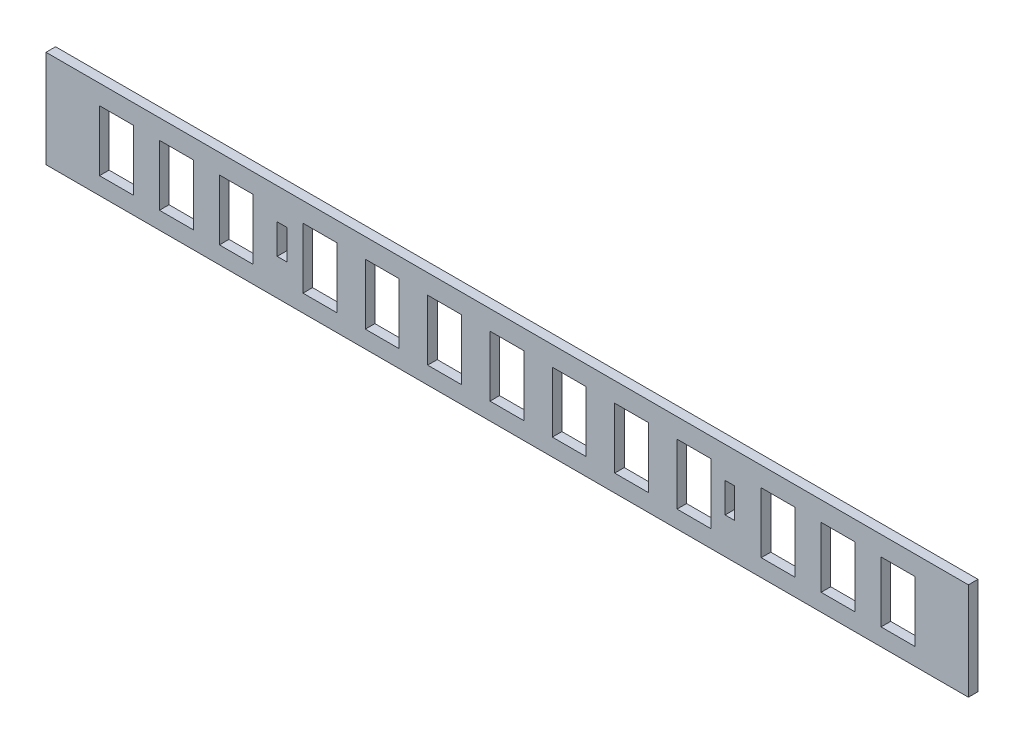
from build123d import *

# Parameters (mm, degrees)
SKETCH1_W           = 146.57537859
SKETCH1_H           = 15.47375446
SKETCH1_W_2         = 1.524
SKETCH1_H_2         = 4.7625
SKETCH1_W_3         = 5.371621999
SKETCH1_H_3         = 9.62692338
BOSS_EXTRUDE1_DEPTH = 1.524


with BuildPart() as part:
    # Sketch1 → Boss-Extrude1 (new body)
    with BuildSketch(Plane.XY):
        with Locations((36.551736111, 156.533282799)):
            Rectangle(SKETCH1_W, SKETCH1_H)
        with Locations((0.762, 156.93074114)):
            Rectangle(SKETCH1_W_2, SKETCH1_H_2, mode=Mode.SUBTRACT)
        with Locations((71.931607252, 156.93074114)):
            Rectangle(SKETCH1_W_2, SKETCH1_H_2, mode=Mode.SUBTRACT)
        with Locations((-25.544872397, 156.353612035)):
            Rectangle(SKETCH1_W_3, SKETCH1_H_3, mode=Mode.SUBTRACT)
        with Locations((-16.019872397, 156.353612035)):
            Rectangle(SKETCH1_W_3, SKETCH1_H_3, mode=Mode.SUBTRACT)
        with Locations((-6.494872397, 156.353612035)):
            Rectangle(SKETCH1_W_3, SKETCH1_H_3, mode=Mode.SUBTRACT)
        with Locations((6.787422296, 156.353612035)):
            Rectangle(SKETCH1_W_3, SKETCH1_H_3, mode=Mode.SUBTRACT)
        with Locations((16.693422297, 156.353612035)):
            Rectangle(SKETCH1_W_3, SKETCH1_H_3, mode=Mode.SUBTRACT)
        with Locations((26.599422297, 156.353612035)):
            Rectangle(SKETCH1_W_3, SKETCH1_H_3, mode=Mode.SUBTRACT)
        with Locations((36.505422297, 156.353612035)):
            Rectangle(SKETCH1_W_3, SKETCH1_H_3, mode=Mode.SUBTRACT)
        with Locations((46.411422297, 156.353612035)):
            Rectangle(SKETCH1_W_3, SKETCH1_H_3, mode=Mode.SUBTRACT)
        with Locations((56.317422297, 156.353612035)):
            Rectangle(SKETCH1_W_3, SKETCH1_H_3, mode=Mode.SUBTRACT)
        with Locations((66.223422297, 156.353612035)):
            Rectangle(SKETCH1_W_3, SKETCH1_H_3, mode=Mode.SUBTRACT)
        with Locations((79.598344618, 156.353612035)):
            Rectangle(SKETCH1_W_3, SKETCH1_H_3, mode=Mode.SUBTRACT)
        with Locations((89.123344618, 156.353612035)):
            Rectangle(SKETCH1_W_3, SKETCH1_H_3, mode=Mode.SUBTRACT)
        with Locations((98.648344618, 156.353612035)):
            Rectangle(SKETCH1_W_3, SKETCH1_H_3, mode=Mode.SUBTRACT)
    extrude(amount=BOSS_EXTRUDE1_DEPTH)


solid = part.part
